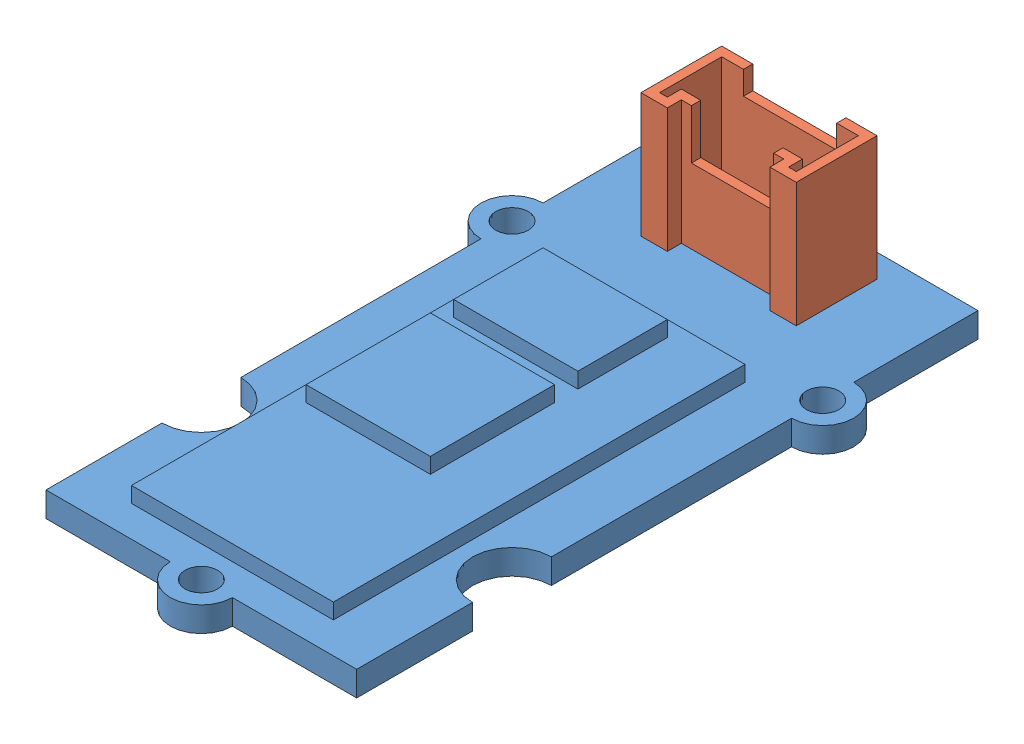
SolidWorks assembly Groves Module WiFi.SLDASM, configuration Défaut (file format 8000). Lengths in mm.
Overall size (24 11.1 42).
2 component instances, 2 part files, 3 mates.
Components (placement in the parent):
- GROVES CI WIFI-1: GROVES CI WIFI.SLDPRT [Défaut] at (-0.5086 -0.8231 31) size (24 3.6 42)
- Connecteur grove-1: Connecteur grove.SLDPRT [Défaut] at (-0.5086 0.7769 22.5) x (-1 0 0) z (0 1 0) size (10 5.2 11.1)
Mates (geometry in assembly coordinates):
- Coïncidente1: coincident anti-aligned: plane of GROVES CI WIFI-1 through (-10.5086 0.7769 31) normal (0 1 0); plane of Connecteur grove-1 through (-0.5086 0.7769 22.5) normal (0 -1 0)
- Distance1: distance = 1.5 mm aligned: plane of Connecteur grove-1 through (4.4914 8.7769 22.5) normal (0 0 -1); plane of GROVES CI WIFI-1 through (2.0314 0.7769 21) normal (0 0 -1)
- Distance2: distance = 5 mm aligned: plane of Connecteur grove-1 through (-5.5086 8.7769 27.7) normal (-1 0 0); plane of GROVES CI WIFI-1 through (-10.5086 0.7769 21) normal (-1 0 0)
